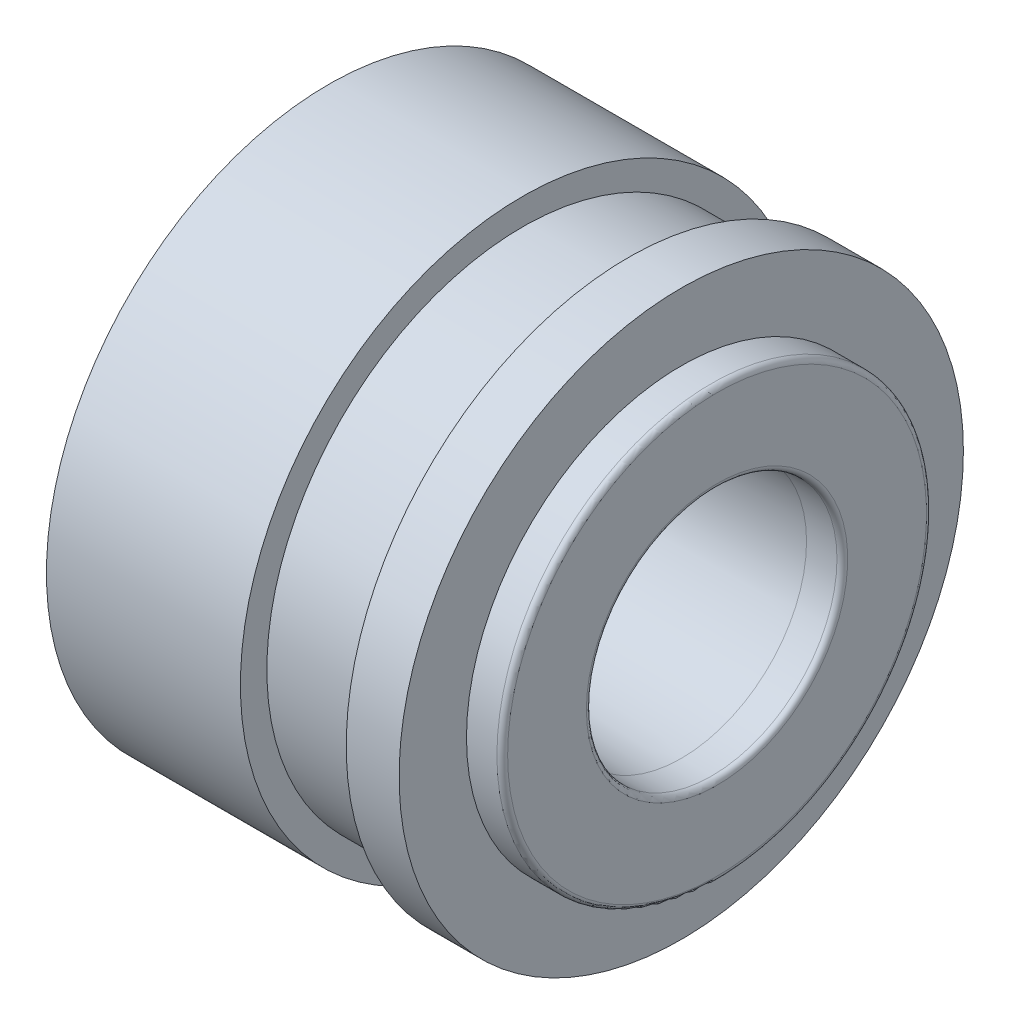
ISO-10303-21;
HEADER;
FILE_DESCRIPTION(('STEP AP214'),'2;1');
FILE_NAME('part.step','',(''),(''),'','','');
FILE_SCHEMA(('AUTOMOTIVE_DESIGN { 1 0 10303 214 1 1 1 1 }'));
ENDSEC;
DATA;
#1=APPLICATION_CONTEXT('core data for automotive mechanical design processes');
#2=APPLICATION_PROTOCOL_DEFINITION('international standard','automotive_design',2000,#1);
#3=PRODUCT_CONTEXT('',#1,'mechanical');
#4=PRODUCT('Part','Part','',(#3));
#5=PRODUCT_RELATED_PRODUCT_CATEGORY('part','',(#4));
#6=PRODUCT_DEFINITION_FORMATION('','',#4);
#7=PRODUCT_DEFINITION_CONTEXT('part definition',#1,'design');
#8=PRODUCT_DEFINITION('design','',#6,#7);
#9=PRODUCT_DEFINITION_SHAPE('','',#8);
#10=(LENGTH_UNIT() NAMED_UNIT(*) SI_UNIT(.MILLI.,.METRE.));
#11=(NAMED_UNIT(*) PLANE_ANGLE_UNIT() SI_UNIT($,.RADIAN.));
#12=(NAMED_UNIT(*) SI_UNIT($,.STERADIAN.) SOLID_ANGLE_UNIT());
#13=UNCERTAINTY_MEASURE_WITH_UNIT(LENGTH_MEASURE(1.E-05),#10,'distance_accuracy_value','');
#14=(GEOMETRIC_REPRESENTATION_CONTEXT(3) GLOBAL_UNCERTAINTY_ASSIGNED_CONTEXT((#13)) GLOBAL_UNIT_ASSIGNED_CONTEXT((#10,
#11,#12)) REPRESENTATION_CONTEXT('',''));
#15=CARTESIAN_POINT('',(0.,0.,0.));
#16=DIRECTION('',(0.,0.,1.));
#17=DIRECTION('',(1.,0.,0.));
#18=AXIS2_PLACEMENT_3D('',#15,#16,#17);
#19=CARTESIAN_POINT('',(-25.,0.,0.));
#20=DIRECTION('',(1.,0.,0.));
#21=DIRECTION('',(0.,0.,-1.));
#22=AXIS2_PLACEMENT_3D('',#19,#20,#21);
#23=CYLINDRICAL_SURFACE('',#22,6.);
#24=CARTESIAN_POINT('',(-24.,0.,0.));
#25=DIRECTION('',(-1.,0.,0.));
#26=DIRECTION('',(0.,0.,1.));
#27=AXIS2_PLACEMENT_3D('',#24,#25,#26);
#28=CIRCLE('',#27,6.);
#29=CARTESIAN_POINT('',(-24.,0.,6.));
#30=VERTEX_POINT('',#29);
#31=EDGE_CURVE('E10',#30,#30,#28,.T.);
#32=ORIENTED_EDGE('',*,*,#31,.T.);
#33=EDGE_LOOP('',(#32));
#34=FACE_BOUND('',#33,.T.);
#35=CARTESIAN_POINT('',(-15.15,0.,0.));
#36=DIRECTION('',(1.,0.,0.));
#37=DIRECTION('',(0.,0.,-1.));
#38=AXIS2_PLACEMENT_3D('',#35,#36,#37);
#39=CIRCLE('',#38,6.);
#40=CARTESIAN_POINT('',(-15.15,0.,-6.));
#41=VERTEX_POINT('',#40);
#42=EDGE_CURVE('E52',#41,#41,#39,.F.);
#43=ORIENTED_EDGE('',*,*,#42,.F.);
#44=EDGE_LOOP('',(#43));
#45=FACE_BOUND('',#44,.T.);
#46=ADVANCED_FACE('F34',(#34,#45),#23,.F.);
#47=CARTESIAN_POINT('',(-5.,16.,0.));
#48=DIRECTION('',(1.,0.,0.));
#49=DIRECTION('',(0.,0.,-1.));
#50=AXIS2_PLACEMENT_3D('',#47,#48,#49);
#51=PLANE('',#50);
#52=CARTESIAN_POINT('',(-5.,0.,0.));
#53=DIRECTION('',(1.,0.,0.));
#54=DIRECTION('',(0.,0.,-1.));
#55=AXIS2_PLACEMENT_3D('',#52,#53,#54);
#56=CIRCLE('',#55,16.);
#57=CARTESIAN_POINT('',(-5.,0.,-16.));
#58=VERTEX_POINT('',#57);
#59=EDGE_CURVE('E45',#58,#58,#56,.T.);
#60=ORIENTED_EDGE('',*,*,#59,.T.);
#61=EDGE_LOOP('',(#60));
#62=FACE_BOUND('',#61,.T.);
#63=CARTESIAN_POINT('',(-5.00000000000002,0.,0.));
#64=DIRECTION('',(-1.,0.,0.));
#65=DIRECTION('',(0.,0.,1.));
#66=AXIS2_PLACEMENT_3D('',#63,#64,#65);
#67=CIRCLE('',#66,12.18);
#68=CARTESIAN_POINT('',(-5.00000000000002,0.,12.18));
#69=VERTEX_POINT('',#68);
#70=EDGE_CURVE('E87',#69,#69,#67,.T.);
#71=ORIENTED_EDGE('',*,*,#70,.T.);
#72=EDGE_LOOP('',(#71));
#73=FACE_BOUND('',#72,.T.);
#74=ADVANCED_FACE('F115',(#62,#73),#51,.T.);
#75=CARTESIAN_POINT('',(35.4425685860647,0.,0.));
#76=DIRECTION('',(1.,0.,0.));
#77=DIRECTION('',(0.,0.,-1.));
#78=AXIS2_PLACEMENT_3D('',#75,#76,#77);
#79=CYLINDRICAL_SURFACE('',#78,16.);
#80=CARTESIAN_POINT('',(-8.,0.,0.));
#81=DIRECTION('',(1.,0.,0.));
#82=DIRECTION('',(0.,0.,-1.));
#83=AXIS2_PLACEMENT_3D('',#80,#81,#82);
#84=CIRCLE('',#83,16.);
#85=CARTESIAN_POINT('',(-8.,0.,-16.));
#86=VERTEX_POINT('',#85);
#87=EDGE_CURVE('E49',#86,#86,#84,.T.);
#88=ORIENTED_EDGE('',*,*,#87,.T.);
#89=EDGE_LOOP('',(#88));
#90=FACE_BOUND('',#89,.T.);
#91=ORIENTED_EDGE('',*,*,#59,.F.);
#92=EDGE_LOOP('',(#91));
#93=FACE_BOUND('',#92,.T.);
#94=ADVANCED_FACE('F122',(#90,#93),#79,.T.);
#95=CARTESIAN_POINT('',(-8.,16.,0.));
#96=DIRECTION('',(-1.,0.,0.));
#97=DIRECTION('',(0.,0.,1.));
#98=AXIS2_PLACEMENT_3D('',#95,#96,#97);
#99=PLANE('',#98);
#100=CARTESIAN_POINT('',(-8.,0.,0.));
#101=DIRECTION('',(1.,0.,0.));
#102=DIRECTION('',(0.,0.,-1.));
#103=AXIS2_PLACEMENT_3D('',#100,#101,#102);
#104=CIRCLE('',#103,14.5);
#105=CARTESIAN_POINT('',(-8.,0.,-14.5));
#106=VERTEX_POINT('',#105);
#107=EDGE_CURVE('E59',#106,#106,#104,.T.);
#108=ORIENTED_EDGE('',*,*,#107,.T.);
#109=EDGE_LOOP('',(#108));
#110=FACE_BOUND('',#109,.T.);
#111=ORIENTED_EDGE('',*,*,#87,.F.);
#112=EDGE_LOOP('',(#111));
#113=FACE_BOUND('',#112,.T.);
#114=ADVANCED_FACE('F143',(#110,#113),#99,.T.);
#115=CARTESIAN_POINT('',(35.4425685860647,0.,0.));
#116=DIRECTION('',(1.,0.,0.));
#117=DIRECTION('',(0.,0.,-1.));
#118=AXIS2_PLACEMENT_3D('',#115,#116,#117);
#119=CYLINDRICAL_SURFACE('',#118,14.5);
#120=CARTESIAN_POINT('',(-14.,0.,0.));
#121=DIRECTION('',(1.,0.,0.));
#122=DIRECTION('',(0.,0.,-1.));
#123=AXIS2_PLACEMENT_3D('',#120,#121,#122);
#124=CIRCLE('',#123,14.5);
#125=CARTESIAN_POINT('',(-14.,0.,-14.5));
#126=VERTEX_POINT('',#125);
#127=EDGE_CURVE('E62',#126,#126,#124,.T.);
#128=ORIENTED_EDGE('',*,*,#127,.T.);
#129=EDGE_LOOP('',(#128));
#130=FACE_BOUND('',#129,.T.);
#131=ORIENTED_EDGE('',*,*,#107,.F.);
#132=EDGE_LOOP('',(#131));
#133=FACE_BOUND('',#132,.T.);
#134=ADVANCED_FACE('F139',(#130,#133),#119,.T.);
#135=CARTESIAN_POINT('',(-14.,14.5,0.));
#136=DIRECTION('',(1.,0.,0.));
#137=DIRECTION('',(0.,0.,-1.));
#138=AXIS2_PLACEMENT_3D('',#135,#136,#137);
#139=PLANE('',#138);
#140=CARTESIAN_POINT('',(-14.,0.,0.));
#141=DIRECTION('',(1.,0.,0.));
#142=DIRECTION('',(0.,0.,-1.));
#143=AXIS2_PLACEMENT_3D('',#140,#141,#142);
#144=CIRCLE('',#143,16.);
#145=CARTESIAN_POINT('',(-14.,0.,-16.));
#146=VERTEX_POINT('',#145);
#147=EDGE_CURVE('E65',#146,#146,#144,.T.);
#148=ORIENTED_EDGE('',*,*,#147,.T.);
#149=EDGE_LOOP('',(#148));
#150=FACE_BOUND('',#149,.T.);
#151=ORIENTED_EDGE('',*,*,#127,.F.);
#152=EDGE_LOOP('',(#151));
#153=FACE_BOUND('',#152,.T.);
#154=ADVANCED_FACE('F135',(#150,#153),#139,.T.);
#155=CARTESIAN_POINT('',(35.4425685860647,0.,0.));
#156=DIRECTION('',(1.,0.,0.));
#157=DIRECTION('',(0.,0.,-1.));
#158=AXIS2_PLACEMENT_3D('',#155,#156,#157);
#159=CYLINDRICAL_SURFACE('',#158,16.);
#160=CARTESIAN_POINT('',(-25.,0.,0.));
#161=DIRECTION('',(1.,0.,0.));
#162=DIRECTION('',(0.,0.,-1.));
#163=AXIS2_PLACEMENT_3D('',#160,#161,#162);
#164=CIRCLE('',#163,16.);
#165=CARTESIAN_POINT('',(-25.,0.,-16.));
#166=VERTEX_POINT('',#165);
#167=EDGE_CURVE('E54',#166,#166,#164,.T.);
#168=ORIENTED_EDGE('',*,*,#167,.T.);
#169=EDGE_LOOP('',(#168));
#170=FACE_BOUND('',#169,.T.);
#171=ORIENTED_EDGE('',*,*,#147,.F.);
#172=EDGE_LOOP('',(#171));
#173=FACE_BOUND('',#172,.T.);
#174=ADVANCED_FACE('F132',(#170,#173),#159,.T.);
#175=CARTESIAN_POINT('',(-25.,16.,0.));
#176=DIRECTION('',(-1.,0.,0.));
#177=DIRECTION('',(0.,0.,1.));
#178=AXIS2_PLACEMENT_3D('',#175,#176,#177);
#179=PLANE('',#178);
#180=CARTESIAN_POINT('',(-25.,0.,0.));
#181=DIRECTION('',(-1.,0.,0.));
#182=DIRECTION('',(0.,0.,1.));
#183=AXIS2_PLACEMENT_3D('',#180,#181,#182);
#184=CIRCLE('',#183,7.00000000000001);
#185=CARTESIAN_POINT('',(-25.,0.,7.00000000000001));
#186=VERTEX_POINT('',#185);
#187=EDGE_CURVE('E41',#186,#186,#184,.F.);
#188=ORIENTED_EDGE('',*,*,#187,.T.);
#189=EDGE_LOOP('',(#188));
#190=FACE_BOUND('',#189,.T.);
#191=ORIENTED_EDGE('',*,*,#167,.F.);
#192=EDGE_LOOP('',(#191));
#193=FACE_BOUND('',#192,.T.);
#194=ADVANCED_FACE('F129',(#190,#193),#179,.T.);
#195=CARTESIAN_POINT('',(-15.15,0.,0.));
#196=DIRECTION('',(1.,0.,0.));
#197=DIRECTION('',(0.,0.,-1.));
#198=AXIS2_PLACEMENT_3D('',#195,#196,#197);
#199=PLANE('',#198);
#200=CARTESIAN_POINT('',(-15.15,0.,0.));
#201=DIRECTION('',(1.,0.,0.));
#202=DIRECTION('',(0.,0.,-1.));
#203=AXIS2_PLACEMENT_3D('',#200,#201,#202);
#204=CIRCLE('',#203,6.50499800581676);
#205=CARTESIAN_POINT('',(-15.15,0.,-6.50499800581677));
#206=VERTEX_POINT('',#205);
#207=EDGE_CURVE('E84',#206,#206,#204,.F.);
#208=ORIENTED_EDGE('',*,*,#207,.F.);
#209=EDGE_LOOP('',(#208));
#210=FACE_BOUND('',#209,.T.);
#211=ORIENTED_EDGE('',*,*,#42,.T.);
#212=EDGE_LOOP('',(#211));
#213=FACE_BOUND('',#212,.T.);
#214=ADVANCED_FACE('F131',(#210,#213),#199,.T.);
#215=CARTESIAN_POINT('',(-59.0194689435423,0.,0.));
#216=DIRECTION('',(-1.,0.,0.));
#217=DIRECTION('',(0.,0.,1.));
#218=AXIS2_PLACEMENT_3D('',#215,#216,#217);
#219=CYLINDRICAL_SURFACE('',#218,12.18);
#220=CARTESIAN_POINT('',(-3.27450000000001,0.,0.));
#221=DIRECTION('',(-1.,0.,0.));
#222=DIRECTION('',(0.,0.,1.));
#223=AXIS2_PLACEMENT_3D('',#220,#221,#222);
#224=CIRCLE('',#223,12.18);
#225=CARTESIAN_POINT('',(-3.27450000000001,0.,12.18));
#226=VERTEX_POINT('',#225);
#227=EDGE_CURVE('E55',#226,#226,#224,.F.);
#228=ORIENTED_EDGE('',*,*,#227,.F.);
#229=EDGE_LOOP('',(#228));
#230=FACE_BOUND('',#229,.T.);
#231=ORIENTED_EDGE('',*,*,#70,.F.);
#232=EDGE_LOOP('',(#231));
#233=FACE_BOUND('',#232,.T.);
#234=ADVANCED_FACE('F158',(#230,#233),#219,.T.);
#235=CARTESIAN_POINT('',(-2.97000000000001,7.105,0.));
#236=DIRECTION('',(-1.,0.,0.));
#237=DIRECTION('',(0.,0.,1.));
#238=AXIS2_PLACEMENT_3D('',#235,#236,#237);
#239=PLANE('',#238);
#240=CARTESIAN_POINT('',(-2.97000000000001,0.,0.));
#241=DIRECTION('',(-1.,0.,0.));
#242=DIRECTION('',(0.,0.,1.));
#243=AXIS2_PLACEMENT_3D('',#240,#241,#242);
#244=CIRCLE('',#243,7.4095);
#245=CARTESIAN_POINT('',(-2.97000000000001,0.,7.40949999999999));
#246=VERTEX_POINT('',#245);
#247=EDGE_CURVE('E72',#246,#246,#244,.F.);
#248=ORIENTED_EDGE('',*,*,#247,.F.);
#249=EDGE_LOOP('',(#248));
#250=FACE_BOUND('',#249,.T.);
#251=CARTESIAN_POINT('',(-2.97000000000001,0.,0.));
#252=DIRECTION('',(-1.,0.,0.));
#253=DIRECTION('',(0.,0.,1.));
#254=AXIS2_PLACEMENT_3D('',#251,#252,#253);
#255=CIRCLE('',#254,11.8755);
#256=CARTESIAN_POINT('',(-2.97000000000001,0.,11.8755));
#257=VERTEX_POINT('',#256);
#258=EDGE_CURVE('E75',#257,#257,#255,.T.);
#259=ORIENTED_EDGE('',*,*,#258,.F.);
#260=EDGE_LOOP('',(#259));
#261=FACE_BOUND('',#260,.T.);
#262=ADVANCED_FACE('F108',(#250,#261),#239,.F.);
#263=CARTESIAN_POINT('',(-59.0194689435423,0.,0.));
#264=DIRECTION('',(-1.,0.,0.));
#265=DIRECTION('',(0.,0.,1.));
#266=AXIS2_PLACEMENT_3D('',#263,#264,#265);
#267=CYLINDRICAL_SURFACE('',#266,7.105);
#268=CARTESIAN_POINT('',(-3.27450000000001,0.,0.));
#269=DIRECTION('',(-1.,0.,0.));
#270=DIRECTION('',(0.,0.,1.));
#271=AXIS2_PLACEMENT_3D('',#268,#269,#270);
#272=CIRCLE('',#271,7.105);
#273=CARTESIAN_POINT('',(-3.27450000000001,0.,7.10499999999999));
#274=VERTEX_POINT('',#273);
#275=EDGE_CURVE('E78',#274,#274,#272,.T.);
#276=ORIENTED_EDGE('',*,*,#275,.F.);
#277=EDGE_LOOP('',(#276));
#278=FACE_BOUND('',#277,.T.);
#279=CARTESIAN_POINT('',(-5.00000000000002,0.,0.));
#280=DIRECTION('',(-1.,0.,0.));
#281=DIRECTION('',(0.,0.,1.));
#282=AXIS2_PLACEMENT_3D('',#279,#280,#281);
#283=CIRCLE('',#282,7.105);
#284=CARTESIAN_POINT('',(-5.00000000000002,0.,7.10499999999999));
#285=VERTEX_POINT('',#284);
#286=EDGE_CURVE('E90',#285,#285,#283,.T.);
#287=ORIENTED_EDGE('',*,*,#286,.T.);
#288=EDGE_LOOP('',(#287));
#289=FACE_BOUND('',#288,.T.);
#290=ADVANCED_FACE('F94',(#278,#289),#267,.F.);
#291=CARTESIAN_POINT('',(-5.00000000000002,0.,0.));
#292=DIRECTION('',(1.,0.,0.));
#293=DIRECTION('',(0.,0.,-1.));
#294=AXIS2_PLACEMENT_3D('',#291,#292,#293);
#295=CONICAL_SURFACE('',#294,7.105,0.0299910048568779);
#296=CARTESIAN_POINT('',(-14.8546308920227,0.,0.));
#297=DIRECTION('',(-1.,0.,0.));
#298=DIRECTION('',(0.,0.,1.));
#299=AXIS2_PLACEMENT_3D('',#296,#297,#298);
#300=CIRCLE('',#299,6.80936107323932);
#301=CARTESIAN_POINT('',(-14.8546308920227,0.,6.80936107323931));
#302=VERTEX_POINT('',#301);
#303=EDGE_CURVE('E81',#302,#302,#300,.F.);
#304=ORIENTED_EDGE('',*,*,#303,.F.);
#305=EDGE_LOOP('',(#304));
#306=FACE_BOUND('',#305,.T.);
#307=ORIENTED_EDGE('',*,*,#286,.F.);
#308=EDGE_LOOP('',(#307));
#309=FACE_BOUND('',#308,.T.);
#310=ADVANCED_FACE('F96',(#306,#309),#295,.F.);
#311=CARTESIAN_POINT('',(-14.8455,0.,0.));
#312=DIRECTION('',(1.,0.,0.));
#313=DIRECTION('',(0.,0.,-1.));
#314=AXIS2_PLACEMENT_3D('',#311,#312,#313);
#315=TOROIDAL_SURFACE('',#314,6.50499800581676,0.3045);
#316=ORIENTED_EDGE('',*,*,#303,.T.);
#317=EDGE_LOOP('',(#316));
#318=FACE_BOUND('',#317,.T.);
#319=ORIENTED_EDGE('',*,*,#207,.T.);
#320=EDGE_LOOP('',(#319));
#321=FACE_BOUND('',#320,.T.);
#322=ADVANCED_FACE('F98',(#318,#321),#315,.F.);
#323=CARTESIAN_POINT('',(-3.27450000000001,0.,0.));
#324=DIRECTION('',(-1.,0.,0.));
#325=DIRECTION('',(0.,0.,1.));
#326=AXIS2_PLACEMENT_3D('',#323,#324,#325);
#327=TOROIDAL_SURFACE('',#326,7.4095,0.3045);
#328=ORIENTED_EDGE('',*,*,#247,.T.);
#329=EDGE_LOOP('',(#328));
#330=FACE_BOUND('',#329,.T.);
#331=ORIENTED_EDGE('',*,*,#275,.T.);
#332=EDGE_LOOP('',(#331));
#333=FACE_BOUND('',#332,.T.);
#334=ADVANCED_FACE('F105',(#330,#333),#327,.T.);
#335=CARTESIAN_POINT('',(-3.27450000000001,0.,0.));
#336=DIRECTION('',(-1.,0.,0.));
#337=DIRECTION('',(0.,0.,1.));
#338=AXIS2_PLACEMENT_3D('',#335,#336,#337);
#339=TOROIDAL_SURFACE('',#338,11.8755,0.3045);
#340=ORIENTED_EDGE('',*,*,#227,.T.);
#341=EDGE_LOOP('',(#340));
#342=FACE_BOUND('',#341,.T.);
#343=ORIENTED_EDGE('',*,*,#258,.T.);
#344=EDGE_LOOP('',(#343));
#345=FACE_BOUND('',#344,.T.);
#346=ADVANCED_FACE('F127',(#342,#345),#339,.T.);
#347=CARTESIAN_POINT('',(-25.,0.,0.));
#348=DIRECTION('',(-1.,0.,0.));
#349=DIRECTION('',(0.,0.,1.));
#350=AXIS2_PLACEMENT_3D('',#347,#348,#349);
#351=CONICAL_SURFACE('',#350,7.00000000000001,0.785398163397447);
#352=ORIENTED_EDGE('',*,*,#31,.F.);
#353=EDGE_LOOP('',(#352));
#354=FACE_BOUND('',#353,.T.);
#355=ORIENTED_EDGE('',*,*,#187,.F.);
#356=EDGE_LOOP('',(#355));
#357=FACE_BOUND('',#356,.T.);
#358=ADVANCED_FACE('F36',(#354,#357),#351,.F.);
#359=CLOSED_SHELL('',(#46,#74,#94,#114,#134,#154,#174,#194,#214,#234,#262,#290,#310,#322,#334,
#346,#358));
#360=MANIFOLD_SOLID_BREP('B2',#359);
#361=ADVANCED_BREP_SHAPE_REPRESENTATION('',(#18,#360),#14);
#362=SHAPE_DEFINITION_REPRESENTATION(#9,#361);
ENDSEC;
END-ISO-10303-21;
